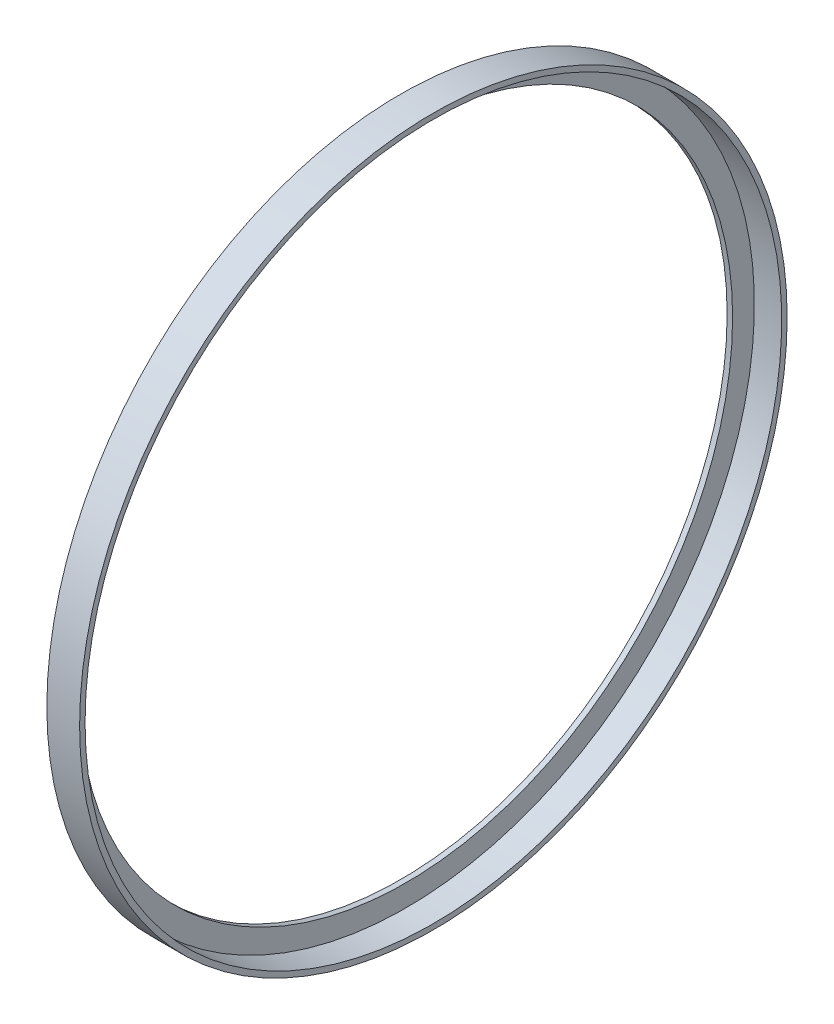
ISO-10303-21;
HEADER;
FILE_DESCRIPTION(('STEP AP214'),'2;1');
FILE_NAME('part.step','',(''),(''),'','','');
FILE_SCHEMA(('AUTOMOTIVE_DESIGN { 1 0 10303 214 1 1 1 1 }'));
ENDSEC;
DATA;
#1=APPLICATION_CONTEXT('core data for automotive mechanical design processes');
#2=APPLICATION_PROTOCOL_DEFINITION('international standard','automotive_design',2000,#1);
#3=PRODUCT_CONTEXT('',#1,'mechanical');
#4=PRODUCT('Part','Part','',(#3));
#5=PRODUCT_RELATED_PRODUCT_CATEGORY('part','',(#4));
#6=PRODUCT_DEFINITION_FORMATION('','',#4);
#7=PRODUCT_DEFINITION_CONTEXT('part definition',#1,'design');
#8=PRODUCT_DEFINITION('design','',#6,#7);
#9=PRODUCT_DEFINITION_SHAPE('','',#8);
#10=(LENGTH_UNIT() NAMED_UNIT(*) SI_UNIT(.MILLI.,.METRE.));
#11=(NAMED_UNIT(*) PLANE_ANGLE_UNIT() SI_UNIT($,.RADIAN.));
#12=(NAMED_UNIT(*) SI_UNIT($,.STERADIAN.) SOLID_ANGLE_UNIT());
#13=UNCERTAINTY_MEASURE_WITH_UNIT(LENGTH_MEASURE(1.E-05),#10,'distance_accuracy_value','');
#14=(GEOMETRIC_REPRESENTATION_CONTEXT(3) GLOBAL_UNCERTAINTY_ASSIGNED_CONTEXT((#13)) GLOBAL_UNIT_ASSIGNED_CONTEXT((#10,
#11,#12)) REPRESENTATION_CONTEXT('',''));
#15=CARTESIAN_POINT('',(0.,0.,0.));
#16=DIRECTION('',(0.,0.,1.));
#17=DIRECTION('',(1.,0.,0.));
#18=AXIS2_PLACEMENT_3D('',#15,#16,#17);
#19=CARTESIAN_POINT('',(4.,0.,0.));
#20=DIRECTION('',(-1.,0.,0.));
#21=DIRECTION('',(0.,0.,1.));
#22=AXIS2_PLACEMENT_3D('',#19,#20,#21);
#23=CYLINDRICAL_SURFACE('',#22,31.895);
#24=CARTESIAN_POINT('',(4.,0.,0.));
#25=DIRECTION('',(-1.,0.,0.));
#26=DIRECTION('',(0.,0.,1.));
#27=AXIS2_PLACEMENT_3D('',#24,#25,#26);
#28=CIRCLE('',#27,31.895);
#29=CARTESIAN_POINT('',(4.,0.,31.895));
#30=VERTEX_POINT('',#29);
#31=EDGE_CURVE('E34',#30,#30,#28,.T.);
#32=ORIENTED_EDGE('',*,*,#31,.F.);
#33=EDGE_LOOP('',(#32));
#34=FACE_BOUND('',#33,.T.);
#35=CARTESIAN_POINT('',(1.5,0.,0.));
#36=DIRECTION('',(-1.,0.,0.));
#37=DIRECTION('',(0.,0.,1.));
#38=AXIS2_PLACEMENT_3D('',#35,#36,#37);
#39=CIRCLE('',#38,31.895);
#40=CARTESIAN_POINT('',(1.5,0.,31.895));
#41=VERTEX_POINT('',#40);
#42=EDGE_CURVE('E18',#41,#41,#39,.F.);
#43=ORIENTED_EDGE('',*,*,#42,.F.);
#44=EDGE_LOOP('',(#43));
#45=FACE_BOUND('',#44,.T.);
#46=ADVANCED_FACE('F14',(#34,#45),#23,.F.);
#47=CARTESIAN_POINT('',(1.5,30.8975,0.));
#48=DIRECTION('',(1.,0.,0.));
#49=DIRECTION('',(0.,0.,-1.));
#50=AXIS2_PLACEMENT_3D('',#47,#48,#49);
#51=PLANE('',#50);
#52=CARTESIAN_POINT('',(1.5,0.,0.));
#53=DIRECTION('',(-1.,0.,0.));
#54=DIRECTION('',(0.,0.,1.));
#55=AXIS2_PLACEMENT_3D('',#52,#53,#54);
#56=CIRCLE('',#55,29.9);
#57=CARTESIAN_POINT('',(1.5,0.,29.9));
#58=VERTEX_POINT('',#57);
#59=EDGE_CURVE('E32',#58,#58,#56,.F.);
#60=ORIENTED_EDGE('',*,*,#59,.F.);
#61=EDGE_LOOP('',(#60));
#62=FACE_BOUND('',#61,.T.);
#63=ORIENTED_EDGE('',*,*,#42,.T.);
#64=EDGE_LOOP('',(#63));
#65=FACE_BOUND('',#64,.T.);
#66=ADVANCED_FACE('F41',(#62,#65),#51,.T.);
#67=CARTESIAN_POINT('',(4.,32.145,0.));
#68=DIRECTION('',(1.,0.,0.));
#69=DIRECTION('',(0.,0.,-1.));
#70=AXIS2_PLACEMENT_3D('',#67,#68,#69);
#71=PLANE('',#70);
#72=ORIENTED_EDGE('',*,*,#31,.T.);
#73=EDGE_LOOP('',(#72));
#74=FACE_BOUND('',#73,.T.);
#75=CARTESIAN_POINT('',(4.,0.,0.));
#76=DIRECTION('',(-1.,0.,0.));
#77=DIRECTION('',(0.,0.,1.));
#78=AXIS2_PLACEMENT_3D('',#75,#76,#77);
#79=CIRCLE('',#78,32.395);
#80=CARTESIAN_POINT('',(4.,0.,32.395));
#81=VERTEX_POINT('',#80);
#82=EDGE_CURVE('E27',#81,#81,#79,.T.);
#83=ORIENTED_EDGE('',*,*,#82,.F.);
#84=EDGE_LOOP('',(#83));
#85=FACE_BOUND('',#84,.T.);
#86=ADVANCED_FACE('F50',(#74,#85),#71,.T.);
#87=CARTESIAN_POINT('',(1.5,0.,0.));
#88=DIRECTION('',(-1.,0.,0.));
#89=DIRECTION('',(0.,0.,1.));
#90=AXIS2_PLACEMENT_3D('',#87,#88,#89);
#91=CYLINDRICAL_SURFACE('',#90,29.9);
#92=ORIENTED_EDGE('',*,*,#59,.T.);
#93=EDGE_LOOP('',(#92));
#94=FACE_BOUND('',#93,.T.);
#95=CARTESIAN_POINT('',(1.,0.,0.));
#96=DIRECTION('',(-1.,0.,0.));
#97=DIRECTION('',(0.,0.,1.));
#98=AXIS2_PLACEMENT_3D('',#95,#96,#97);
#99=CIRCLE('',#98,29.9);
#100=CARTESIAN_POINT('',(1.,0.,29.9));
#101=VERTEX_POINT('',#100);
#102=EDGE_CURVE('E22',#101,#101,#99,.F.);
#103=ORIENTED_EDGE('',*,*,#102,.F.);
#104=EDGE_LOOP('',(#103));
#105=FACE_BOUND('',#104,.T.);
#106=ADVANCED_FACE('F58',(#94,#105),#91,.F.);
#107=CARTESIAN_POINT('',(2.5,0.,0.));
#108=DIRECTION('',(-1.,0.,0.));
#109=DIRECTION('',(0.,0.,1.));
#110=AXIS2_PLACEMENT_3D('',#107,#108,#109);
#111=CYLINDRICAL_SURFACE('',#110,32.395);
#112=CARTESIAN_POINT('',(1.,0.,0.));
#113=DIRECTION('',(-1.,0.,0.));
#114=DIRECTION('',(0.,0.,1.));
#115=AXIS2_PLACEMENT_3D('',#112,#113,#114);
#116=CIRCLE('',#115,32.395);
#117=CARTESIAN_POINT('',(1.,0.,32.395));
#118=VERTEX_POINT('',#117);
#119=EDGE_CURVE('E10',#118,#118,#116,.T.);
#120=ORIENTED_EDGE('',*,*,#119,.F.);
#121=EDGE_LOOP('',(#120));
#122=FACE_BOUND('',#121,.T.);
#123=ORIENTED_EDGE('',*,*,#82,.T.);
#124=EDGE_LOOP('',(#123));
#125=FACE_BOUND('',#124,.T.);
#126=ADVANCED_FACE('F54',(#122,#125),#111,.T.);
#127=CARTESIAN_POINT('',(1.,31.1475,0.));
#128=DIRECTION('',(-1.,0.,0.));
#129=DIRECTION('',(0.,0.,1.));
#130=AXIS2_PLACEMENT_3D('',#127,#128,#129);
#131=PLANE('',#130);
#132=ORIENTED_EDGE('',*,*,#119,.T.);
#133=EDGE_LOOP('',(#132));
#134=FACE_BOUND('',#133,.T.);
#135=ORIENTED_EDGE('',*,*,#102,.T.);
#136=EDGE_LOOP('',(#135));
#137=FACE_BOUND('',#136,.T.);
#138=ADVANCED_FACE('F16',(#134,#137),#131,.T.);
#139=CLOSED_SHELL('',(#46,#66,#86,#106,#126,#138));
#140=MANIFOLD_SOLID_BREP('B1',#139);
#141=ADVANCED_BREP_SHAPE_REPRESENTATION('',(#18,#140),#14);
#142=SHAPE_DEFINITION_REPRESENTATION(#9,#141);
ENDSEC;
END-ISO-10303-21;
